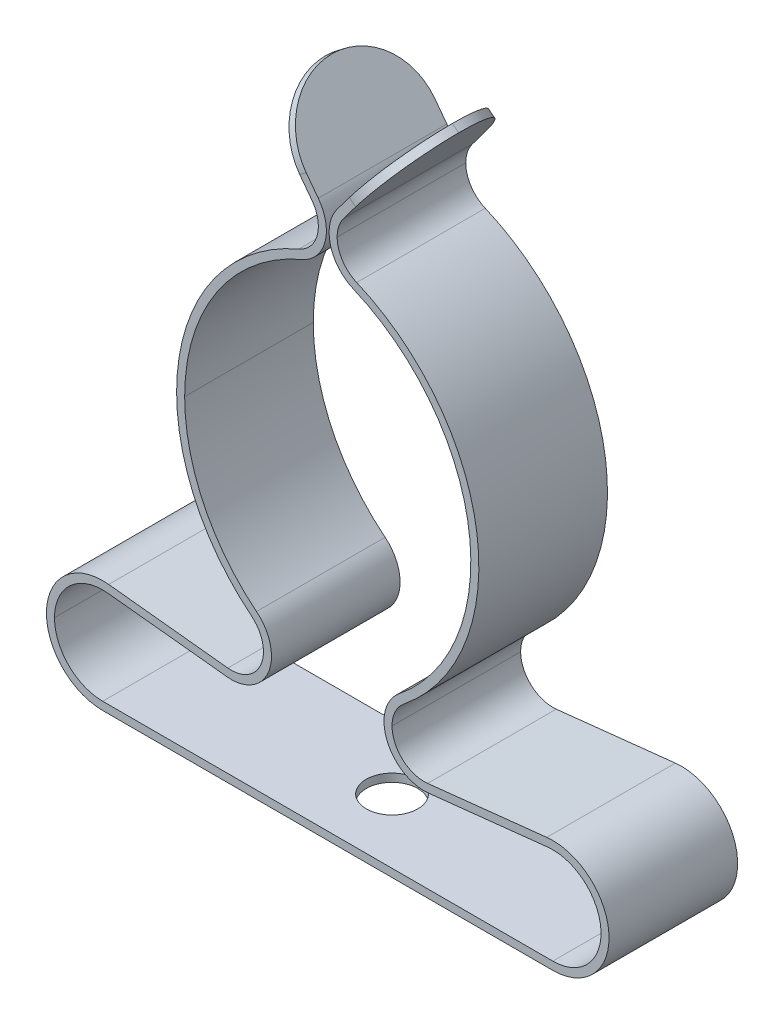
ISO-10303-21;
HEADER;
FILE_DESCRIPTION(('STEP AP214'),'2;1');
FILE_NAME('part.step','',(''),(''),'','','');
FILE_SCHEMA(('AUTOMOTIVE_DESIGN { 1 0 10303 214 1 1 1 1 }'));
ENDSEC;
DATA;
#1=APPLICATION_CONTEXT('core data for automotive mechanical design processes');
#2=APPLICATION_PROTOCOL_DEFINITION('international standard','automotive_design',2000,#1);
#3=PRODUCT_CONTEXT('',#1,'mechanical');
#4=PRODUCT('Part','Part','',(#3));
#5=PRODUCT_RELATED_PRODUCT_CATEGORY('part','',(#4));
#6=PRODUCT_DEFINITION_FORMATION('','',#4);
#7=PRODUCT_DEFINITION_CONTEXT('part definition',#1,'design');
#8=PRODUCT_DEFINITION('design','',#6,#7);
#9=PRODUCT_DEFINITION_SHAPE('','',#8);
#10=(LENGTH_UNIT() NAMED_UNIT(*) SI_UNIT(.MILLI.,.METRE.));
#11=(NAMED_UNIT(*) PLANE_ANGLE_UNIT() SI_UNIT($,.RADIAN.));
#12=(NAMED_UNIT(*) SI_UNIT($,.STERADIAN.) SOLID_ANGLE_UNIT());
#13=UNCERTAINTY_MEASURE_WITH_UNIT(LENGTH_MEASURE(1.E-05),#10,'distance_accuracy_value','');
#14=(GEOMETRIC_REPRESENTATION_CONTEXT(3) GLOBAL_UNCERTAINTY_ASSIGNED_CONTEXT((#13)) GLOBAL_UNIT_ASSIGNED_CONTEXT((#10,
#11,#12)) REPRESENTATION_CONTEXT('',''));
#15=CARTESIAN_POINT('',(0.,0.,0.));
#16=DIRECTION('',(0.,0.,1.));
#17=DIRECTION('',(1.,0.,0.));
#18=AXIS2_PLACEMENT_3D('',#15,#16,#17);
#19=CARTESIAN_POINT('',(3.33888915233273,33.3009588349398,0.));
#20=DIRECTION('',(0.798579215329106,-0.601889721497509,0.));
#21=DIRECTION('',(0.601889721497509,0.798579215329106,0.));
#22=AXIS2_PLACEMENT_3D('',#19,#20,#21);
#23=CYLINDRICAL_SURFACE('',#22,4.);
#24=CARTESIAN_POINT('',(1.34244111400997,34.8056831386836,0.));
#25=DIRECTION('',(-0.798579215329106,0.601889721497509,0.));
#26=DIRECTION('',(-0.601889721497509,-0.798579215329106,0.));
#27=AXIS2_PLACEMENT_3D('',#24,#25,#26);
#28=CIRCLE('',#27,4.);
#29=CARTESIAN_POINT('',(3.75,38.,0.));
#30=VERTEX_POINT('',#29);
#31=CARTESIAN_POINT('',(1.34244111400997,34.8056831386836,-4.));
#32=VERTEX_POINT('',#31);
#33=EDGE_CURVE('E321',#30,#32,#28,.T.);
#34=ORIENTED_EDGE('',*,*,#33,.F.);
#35=DIRECTION('',(0.798579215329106,-0.601889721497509,0.));
#36=VECTOR('',#35,1.);
#37=CARTESIAN_POINT('',(4.14928960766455,37.6990551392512,0.));
#38=LINE('',#37,#36);
#39=CARTESIAN_POINT('',(4.14928960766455,37.6990551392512,0.));
#40=VERTEX_POINT('',#39);
#41=EDGE_CURVE('E9',#30,#40,#38,.T.);
#42=ORIENTED_EDGE('',*,*,#41,.T.);
#43=CARTESIAN_POINT('',(1.74173072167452,34.5047382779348,0.));
#44=DIRECTION('',(0.798579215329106,-0.601889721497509,0.));
#45=DIRECTION('',(-0.601889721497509,-0.798579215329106,0.));
#46=AXIS2_PLACEMENT_3D('',#43,#44,#45);
#47=CIRCLE('',#46,4.);
#48=CARTESIAN_POINT('',(1.74173072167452,34.5047382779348,-4.));
#49=VERTEX_POINT('',#48);
#50=EDGE_CURVE('E406',#49,#40,#47,.T.);
#51=ORIENTED_EDGE('',*,*,#50,.F.);
#52=DIRECTION('',(0.798579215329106,-0.601889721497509,0.));
#53=VECTOR('',#52,1.);
#54=CARTESIAN_POINT('',(3.33888915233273,33.3009588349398,-4.));
#55=LINE('',#54,#53);
#56=EDGE_CURVE('E302',#32,#49,#55,.T.);
#57=ORIENTED_EDGE('',*,*,#56,.F.);
#58=EDGE_LOOP('',(#34,#42,#51,#57));
#59=FACE_BOUND('',#58,.T.);
#60=ADVANCED_FACE('F15',(#59),#23,.T.);
#61=CARTESIAN_POINT('',(1.34244111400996,34.8056831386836,0.));
#62=DIRECTION('',(-0.798579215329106,0.601889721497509,0.));
#63=DIRECTION('',(-0.601889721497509,-0.798579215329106,0.));
#64=AXIS2_PLACEMENT_3D('',#61,#62,#63);
#65=CYLINDRICAL_SURFACE('',#64,4.);
#66=ORIENTED_EDGE('',*,*,#41,.F.);
#67=CARTESIAN_POINT('',(1.34244111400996,34.8056831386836,0.));
#68=DIRECTION('',(-0.798579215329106,0.601889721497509,0.));
#69=DIRECTION('',(-0.601889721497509,-0.798579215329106,0.));
#70=AXIS2_PLACEMENT_3D('',#67,#68,#69);
#71=CIRCLE('',#70,4.);
#72=CARTESIAN_POINT('',(1.34244111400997,34.8056831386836,4.));
#73=VERTEX_POINT('',#72);
#74=EDGE_CURVE('E325',#73,#30,#71,.T.);
#75=ORIENTED_EDGE('',*,*,#74,.F.);
#76=DIRECTION('',(-0.798579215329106,0.601889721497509,0.));
#77=VECTOR('',#76,1.);
#78=CARTESIAN_POINT('',(1.34244111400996,34.8056831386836,4.));
#79=LINE('',#78,#77);
#80=CARTESIAN_POINT('',(1.74173072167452,34.5047382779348,4.));
#81=VERTEX_POINT('',#80);
#82=EDGE_CURVE('E299',#81,#73,#79,.T.);
#83=ORIENTED_EDGE('',*,*,#82,.F.);
#84=CARTESIAN_POINT('',(1.74173072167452,34.5047382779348,0.));
#85=DIRECTION('',(0.798579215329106,-0.601889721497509,0.));
#86=DIRECTION('',(-0.601889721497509,-0.798579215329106,0.));
#87=AXIS2_PLACEMENT_3D('',#84,#85,#86);
#88=CIRCLE('',#87,4.);
#89=EDGE_CURVE('E410',#40,#81,#88,.T.);
#90=ORIENTED_EDGE('',*,*,#89,.F.);
#91=EDGE_LOOP('',(#66,#75,#83,#90));
#92=FACE_BOUND('',#91,.T.);
#93=ADVANCED_FACE('F960',(#92),#65,.T.);
#94=CARTESIAN_POINT('',(-0.0425128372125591,35.7854400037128,0.));
#95=DIRECTION('',(0.798579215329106,0.601889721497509,0.));
#96=DIRECTION('',(-0.601889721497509,0.798579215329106,0.));
#97=AXIS2_PLACEMENT_3D('',#94,#95,#96);
#98=CYLINDRICAL_SURFACE('',#97,4.);
#99=CARTESIAN_POINT('',(-1.74173072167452,34.5047382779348,0.));
#100=DIRECTION('',(-0.798579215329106,-0.601889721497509,0.));
#101=DIRECTION('',(-0.601889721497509,0.798579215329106,0.));
#102=AXIS2_PLACEMENT_3D('',#99,#100,#101);
#103=CIRCLE('',#102,4.);
#104=CARTESIAN_POINT('',(-4.14928960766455,37.6990551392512,0.));
#105=VERTEX_POINT('',#104);
#106=CARTESIAN_POINT('',(-1.74173072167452,34.5047382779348,-4.));
#107=VERTEX_POINT('',#106);
#108=EDGE_CURVE('E458',#105,#107,#103,.T.);
#109=ORIENTED_EDGE('',*,*,#108,.F.);
#110=DIRECTION('',(0.798579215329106,0.601889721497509,0.));
#111=VECTOR('',#110,1.);
#112=CARTESIAN_POINT('',(-3.75,38.,0.));
#113=LINE('',#112,#111);
#114=CARTESIAN_POINT('',(-3.75,38.,0.));
#115=VERTEX_POINT('',#114);
#116=EDGE_CURVE('E23',#105,#115,#113,.T.);
#117=ORIENTED_EDGE('',*,*,#116,.T.);
#118=CARTESIAN_POINT('',(-1.34244111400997,34.8056831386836,0.));
#119=DIRECTION('',(0.798579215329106,0.601889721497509,0.));
#120=DIRECTION('',(-0.601889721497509,0.798579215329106,0.));
#121=AXIS2_PLACEMENT_3D('',#118,#119,#120);
#122=CIRCLE('',#121,4.);
#123=CARTESIAN_POINT('',(-1.34244111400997,34.8056831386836,-4.));
#124=VERTEX_POINT('',#123);
#125=EDGE_CURVE('E531',#124,#115,#122,.T.);
#126=ORIENTED_EDGE('',*,*,#125,.F.);
#127=DIRECTION('',(0.798579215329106,0.601889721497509,0.));
#128=VECTOR('',#127,1.);
#129=CARTESIAN_POINT('',(-0.0425128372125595,35.7854400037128,-4.));
#130=LINE('',#129,#128);
#131=EDGE_CURVE('E300',#107,#124,#130,.T.);
#132=ORIENTED_EDGE('',*,*,#131,.F.);
#133=EDGE_LOOP('',(#109,#117,#126,#132));
#134=FACE_BOUND('',#133,.T.);
#135=ADVANCED_FACE('F919',(#134),#98,.T.);
#136=CARTESIAN_POINT('',(-1.74173072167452,34.5047382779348,0.));
#137=DIRECTION('',(-0.798579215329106,-0.601889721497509,0.));
#138=DIRECTION('',(0.601889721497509,-0.798579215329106,0.));
#139=AXIS2_PLACEMENT_3D('',#136,#137,#138);
#140=CYLINDRICAL_SURFACE('',#139,4.);
#141=ORIENTED_EDGE('',*,*,#116,.F.);
#142=CARTESIAN_POINT('',(-1.74173072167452,34.5047382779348,0.));
#143=DIRECTION('',(-0.798579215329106,-0.601889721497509,0.));
#144=DIRECTION('',(-0.601889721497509,0.798579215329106,0.));
#145=AXIS2_PLACEMENT_3D('',#142,#143,#144);
#146=CIRCLE('',#145,4.);
#147=CARTESIAN_POINT('',(-1.74173072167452,34.5047382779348,4.));
#148=VERTEX_POINT('',#147);
#149=EDGE_CURVE('E454',#148,#105,#146,.T.);
#150=ORIENTED_EDGE('',*,*,#149,.F.);
#151=DIRECTION('',(-0.798579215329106,-0.601889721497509,0.));
#152=VECTOR('',#151,1.);
#153=CARTESIAN_POINT('',(-1.74173072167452,34.5047382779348,4.));
#154=LINE('',#153,#152);
#155=CARTESIAN_POINT('',(-1.34244111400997,34.8056831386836,4.));
#156=VERTEX_POINT('',#155);
#157=EDGE_CURVE('E297',#156,#148,#154,.T.);
#158=ORIENTED_EDGE('',*,*,#157,.F.);
#159=CARTESIAN_POINT('',(-1.34244111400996,34.8056831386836,0.));
#160=DIRECTION('',(0.798579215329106,0.601889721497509,0.));
#161=DIRECTION('',(-0.601889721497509,0.798579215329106,0.));
#162=AXIS2_PLACEMENT_3D('',#159,#160,#161);
#163=CIRCLE('',#162,4.);
#164=EDGE_CURVE('E775',#115,#156,#163,.T.);
#165=ORIENTED_EDGE('',*,*,#164,.F.);
#166=EDGE_LOOP('',(#141,#150,#158,#165));
#167=FACE_BOUND('',#166,.T.);
#168=ADVANCED_FACE('F909',(#167),#140,.T.);
#169=CARTESIAN_POINT('',(0.,4.5254833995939,0.));
#170=DIRECTION('',(0.,-1.,0.));
#171=DIRECTION('',(0.,0.,-1.));
#172=AXIS2_PLACEMENT_3D('',#169,#170,#171);
#173=CYLINDRICAL_SURFACE('',#172,1.6);
#174=DIRECTION('',(0.,-1.,0.));
#175=VECTOR('',#174,1.);
#176=CARTESIAN_POINT('',(0.,4.5254833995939,1.6));
#177=LINE('',#176,#175);
#178=CARTESIAN_POINT('',(0.,0.,1.6));
#179=VERTEX_POINT('',#178);
#180=CARTESIAN_POINT('',(0.,-0.5,1.6));
#181=VERTEX_POINT('',#180);
#182=EDGE_CURVE('E837',#179,#181,#177,.T.);
#183=ORIENTED_EDGE('',*,*,#182,.F.);
#184=CARTESIAN_POINT('',(0.,0.,0.));
#185=DIRECTION('',(0.,-1.,0.));
#186=DIRECTION('',(0.,0.,1.));
#187=AXIS2_PLACEMENT_3D('',#184,#185,#186);
#188=CIRCLE('',#187,1.6);
#189=CARTESIAN_POINT('',(0.,0.,-1.6));
#190=VERTEX_POINT('',#189);
#191=EDGE_CURVE('E506',#190,#179,#188,.T.);
#192=ORIENTED_EDGE('',*,*,#191,.F.);
#193=DIRECTION('',(0.,-1.,0.));
#194=VECTOR('',#193,1.);
#195=CARTESIAN_POINT('',(0.,4.5254833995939,-1.6));
#196=LINE('',#195,#194);
#197=CARTESIAN_POINT('',(0.,-0.5,-1.6));
#198=VERTEX_POINT('',#197);
#199=EDGE_CURVE('E824',#190,#198,#196,.T.);
#200=ORIENTED_EDGE('',*,*,#199,.T.);
#201=CARTESIAN_POINT('',(0.,-0.5,0.));
#202=DIRECTION('',(0.,-1.,0.));
#203=DIRECTION('',(0.,0.,-1.));
#204=AXIS2_PLACEMENT_3D('',#201,#202,#203);
#205=CIRCLE('',#204,1.6);
#206=EDGE_CURVE('E419',#198,#181,#205,.T.);
#207=ORIENTED_EDGE('',*,*,#206,.T.);
#208=EDGE_LOOP('',(#183,#192,#200,#207));
#209=FACE_BOUND('',#208,.T.);
#210=ADVANCED_FACE('F1287',(#209),#173,.F.);
#211=CARTESIAN_POINT('',(2.58446576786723,32.3,-4.));
#212=DIRECTION('',(0.,0.,-1.));
#213=DIRECTION('',(0.,-1.,0.));
#214=AXIS2_PLACEMENT_3D('',#211,#212,#213);
#215=PLANE('',#214);
#216=DIRECTION('',(0.601889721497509,-0.798579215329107,0.));
#217=VECTOR('',#216,1.);
#218=CARTESIAN_POINT('',(-0.987307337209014,33.503779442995,-4.));
#219=LINE('',#218,#217);
#220=CARTESIAN_POINT('',(-0.987307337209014,33.503779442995,-4.));
#221=VERTEX_POINT('',#220);
#222=EDGE_CURVE('E467',#107,#221,#219,.T.);
#223=ORIENTED_EDGE('',*,*,#222,.F.);
#224=ORIENTED_EDGE('',*,*,#131,.T.);
#225=DIRECTION('',(0.601889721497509,-0.798579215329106,0.));
#226=VECTOR('',#225,1.);
#227=CARTESIAN_POINT('',(-0.588017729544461,33.8047243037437,-4.));
#228=LINE('',#227,#226);
#229=CARTESIAN_POINT('',(-0.588017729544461,33.8047243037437,-4.));
#230=VERTEX_POINT('',#229);
#231=EDGE_CURVE('E528',#124,#230,#228,.T.);
#232=ORIENTED_EDGE('',*,*,#231,.T.);
#233=CARTESIAN_POINT('',(-2.58446576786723,32.3,-4.));
#234=DIRECTION('',(0.,0.,-1.));
#235=DIRECTION('',(1.,0.,0.));
#236=AXIS2_PLACEMENT_3D('',#233,#234,#235);
#237=CIRCLE('',#236,2.5);
#238=CARTESIAN_POINT('',(-1.60466987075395,30.,-4.));
#239=VERTEX_POINT('',#238);
#240=EDGE_CURVE('E517',#230,#239,#237,.T.);
#241=ORIENTED_EDGE('',*,*,#240,.T.);
#242=CARTESIAN_POINT('',(3.0983504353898,18.96,-4.));
#243=DIRECTION('',(0.,0.,1.));
#244=DIRECTION('',(-1.,0.,0.));
#245=AXIS2_PLACEMENT_3D('',#242,#243,#244);
#246=CIRCLE('',#245,12.);
#247=CARTESIAN_POINT('',(-8.90164956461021,18.96,-4.));
#248=VERTEX_POINT('',#247);
#249=EDGE_CURVE('E319',#239,#248,#246,.T.);
#250=ORIENTED_EDGE('',*,*,#249,.T.);
#251=CARTESIAN_POINT('',(3.0983504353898,18.96,-4.));
#252=DIRECTION('',(0.,0.,1.));
#253=DIRECTION('',(-1.,0.,0.));
#254=AXIS2_PLACEMENT_3D('',#251,#252,#253);
#255=CIRCLE('',#254,12.);
#256=CARTESIAN_POINT('',(-4.43131889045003,9.61633477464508,-4.));
#257=VERTEX_POINT('',#256);
#258=EDGE_CURVE('E428',#248,#257,#255,.T.);
#259=ORIENTED_EDGE('',*,*,#258,.T.);
#260=CARTESIAN_POINT('',(-6.,7.66973785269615,-4.));
#261=DIRECTION('',(0.,0.,-1.));
#262=DIRECTION('',(1.,0.,0.));
#263=AXIS2_PLACEMENT_3D('',#260,#261,#262);
#264=CIRCLE('',#263,2.5);
#265=CARTESIAN_POINT('',(-6.26785714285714,5.18412876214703,-4.));
#266=VERTEX_POINT('',#265);
#267=EDGE_CURVE('E402',#257,#266,#264,.T.);
#268=ORIENTED_EDGE('',*,*,#267,.T.);
#269=DIRECTION('',(-0.994243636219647,0.107142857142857,0.));
#270=VECTOR('',#269,1.);
#271=CARTESIAN_POINT('',(-13.6785714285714,5.98273090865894,-4.));
#272=LINE('',#271,#270);
#273=CARTESIAN_POINT('',(-13.6785714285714,5.98273090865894,-4.));
#274=VERTEX_POINT('',#273);
#275=EDGE_CURVE('E385',#266,#274,#272,.T.);
#276=ORIENTED_EDGE('',*,*,#275,.T.);
#277=CARTESIAN_POINT('',(-14.,3.,-4.));
#278=DIRECTION('',(0.,0.,1.));
#279=DIRECTION('',(-1.,0.,0.));
#280=AXIS2_PLACEMENT_3D('',#277,#278,#279);
#281=CIRCLE('',#280,3.);
#282=CARTESIAN_POINT('',(-17.,3.,-4.));
#283=VERTEX_POINT('',#282);
#284=EDGE_CURVE('E338',#274,#283,#281,.T.);
#285=ORIENTED_EDGE('',*,*,#284,.T.);
#286=CARTESIAN_POINT('',(-14.,3.,-4.));
#287=DIRECTION('',(0.,0.,1.));
#288=DIRECTION('',(-1.,0.,0.));
#289=AXIS2_PLACEMENT_3D('',#286,#287,#288);
#290=CIRCLE('',#289,3.);
#291=CARTESIAN_POINT('',(-14.,0.,-4.));
#292=VERTEX_POINT('',#291);
#293=EDGE_CURVE('E389',#283,#292,#290,.T.);
#294=ORIENTED_EDGE('',*,*,#293,.T.);
#295=DIRECTION('',(1.,0.,0.));
#296=VECTOR('',#295,1.);
#297=CARTESIAN_POINT('',(-14.,0.,-4.));
#298=LINE('',#297,#296);
#299=CARTESIAN_POINT('',(14.,0.,-4.));
#300=VERTEX_POINT('',#299);
#301=EDGE_CURVE('E495',#292,#300,#298,.T.);
#302=ORIENTED_EDGE('',*,*,#301,.T.);
#303=CARTESIAN_POINT('',(14.,3.,-4.));
#304=DIRECTION('',(0.,0.,1.));
#305=DIRECTION('',(1.,0.,0.));
#306=AXIS2_PLACEMENT_3D('',#303,#304,#305);
#307=CIRCLE('',#306,3.);
#308=CARTESIAN_POINT('',(13.6785714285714,5.98273090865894,-4.));
#309=VERTEX_POINT('',#308);
#310=EDGE_CURVE('E481',#300,#309,#307,.T.);
#311=ORIENTED_EDGE('',*,*,#310,.T.);
#312=DIRECTION('',(-0.994243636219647,-0.107142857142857,0.));
#313=VECTOR('',#312,1.);
#314=CARTESIAN_POINT('',(13.6785714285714,5.98273090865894,-4.));
#315=LINE('',#314,#313);
#316=CARTESIAN_POINT('',(6.26785714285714,5.18412876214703,-4.));
#317=VERTEX_POINT('',#316);
#318=EDGE_CURVE('E350',#309,#317,#315,.T.);
#319=ORIENTED_EDGE('',*,*,#318,.T.);
#320=CARTESIAN_POINT('',(6.,7.66973785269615,-4.));
#321=DIRECTION('',(0.,0.,-1.));
#322=DIRECTION('',(-1.,0.,0.));
#323=AXIS2_PLACEMENT_3D('',#320,#321,#322);
#324=CIRCLE('',#323,2.5);
#325=CARTESIAN_POINT('',(3.5,7.66973785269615,-4.));
#326=VERTEX_POINT('',#325);
#327=EDGE_CURVE('E368',#317,#326,#324,.T.);
#328=ORIENTED_EDGE('',*,*,#327,.T.);
#329=CARTESIAN_POINT('',(6.,7.66973785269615,-4.));
#330=DIRECTION('',(0.,0.,-1.));
#331=DIRECTION('',(-1.,0.,0.));
#332=AXIS2_PLACEMENT_3D('',#329,#330,#331);
#333=CIRCLE('',#332,2.5);
#334=CARTESIAN_POINT('',(4.43131889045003,9.61633477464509,-4.));
#335=VERTEX_POINT('',#334);
#336=EDGE_CURVE('E470',#326,#335,#333,.T.);
#337=ORIENTED_EDGE('',*,*,#336,.T.);
#338=CARTESIAN_POINT('',(-3.0983504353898,18.96,-4.));
#339=DIRECTION('',(0.,0.,1.));
#340=DIRECTION('',(1.,0.,0.));
#341=AXIS2_PLACEMENT_3D('',#338,#339,#340);
#342=CIRCLE('',#341,12.);
#343=CARTESIAN_POINT('',(1.60466987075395,30.,-4.));
#344=VERTEX_POINT('',#343);
#345=EDGE_CURVE('E446',#335,#344,#342,.T.);
#346=ORIENTED_EDGE('',*,*,#345,.T.);
#347=CARTESIAN_POINT('',(2.58446576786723,32.3,-4.));
#348=DIRECTION('',(0.,0.,-1.));
#349=DIRECTION('',(-1.,0.,0.));
#350=AXIS2_PLACEMENT_3D('',#347,#348,#349);
#351=CIRCLE('',#350,2.5);
#352=CARTESIAN_POINT('',(0.0844657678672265,32.3,-4.));
#353=VERTEX_POINT('',#352);
#354=EDGE_CURVE('E384',#344,#353,#351,.T.);
#355=ORIENTED_EDGE('',*,*,#354,.T.);
#356=CARTESIAN_POINT('',(2.58446576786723,32.3,-4.));
#357=DIRECTION('',(0.,0.,-1.));
#358=DIRECTION('',(-1.,0.,0.));
#359=AXIS2_PLACEMENT_3D('',#356,#357,#358);
#360=CIRCLE('',#359,2.5);
#361=CARTESIAN_POINT('',(0.588017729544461,33.8047243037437,-4.));
#362=VERTEX_POINT('',#361);
#363=EDGE_CURVE('E445',#353,#362,#360,.T.);
#364=ORIENTED_EDGE('',*,*,#363,.T.);
#365=DIRECTION('',(0.601889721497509,0.798579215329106,0.));
#366=VECTOR('',#365,1.);
#367=CARTESIAN_POINT('',(0.588017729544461,33.8047243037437,-4.));
#368=LINE('',#367,#366);
#369=EDGE_CURVE('E324',#362,#32,#368,.T.);
#370=ORIENTED_EDGE('',*,*,#369,.T.);
#371=ORIENTED_EDGE('',*,*,#56,.T.);
#372=DIRECTION('',(0.601889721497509,0.798579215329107,0.));
#373=VECTOR('',#372,1.);
#374=CARTESIAN_POINT('',(0.987307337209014,33.503779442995,-4.));
#375=LINE('',#374,#373);
#376=CARTESIAN_POINT('',(0.987307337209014,33.503779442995,-4.));
#377=VERTEX_POINT('',#376);
#378=EDGE_CURVE('E401',#377,#49,#375,.T.);
#379=ORIENTED_EDGE('',*,*,#378,.F.);
#380=CARTESIAN_POINT('',(2.58446576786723,32.3,-4.));
#381=DIRECTION('',(0.,0.,-1.));
#382=DIRECTION('',(1.,0.,0.));
#383=AXIS2_PLACEMENT_3D('',#380,#381,#382);
#384=CIRCLE('',#383,2.);
#385=CARTESIAN_POINT('',(0.584465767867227,32.3,-4.));
#386=VERTEX_POINT('',#385);
#387=EDGE_CURVE('E794',#386,#377,#384,.T.);
#388=ORIENTED_EDGE('',*,*,#387,.F.);
#389=CARTESIAN_POINT('',(2.58446576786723,32.3,-4.));
#390=DIRECTION('',(0.,0.,-1.));
#391=DIRECTION('',(1.,0.,0.));
#392=AXIS2_PLACEMENT_3D('',#389,#390,#391);
#393=CIRCLE('',#392,2.);
#394=CARTESIAN_POINT('',(1.80062905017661,30.46,-4.));
#395=VERTEX_POINT('',#394);
#396=EDGE_CURVE('E47',#395,#386,#393,.T.);
#397=ORIENTED_EDGE('',*,*,#396,.F.);
#398=CARTESIAN_POINT('',(-3.0983504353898,18.96,-4.));
#399=DIRECTION('',(0.,0.,1.));
#400=DIRECTION('',(1.,0.,0.));
#401=AXIS2_PLACEMENT_3D('',#398,#399,#400);
#402=CIRCLE('',#401,12.5);
#403=CARTESIAN_POINT('',(4.74505511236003,9.22701539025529,-4.));
#404=VERTEX_POINT('',#403);
#405=EDGE_CURVE('E257',#404,#395,#402,.T.);
#406=ORIENTED_EDGE('',*,*,#405,.F.);
#407=CARTESIAN_POINT('',(6.,7.66973785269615,-4.));
#408=DIRECTION('',(0.,0.,-1.));
#409=DIRECTION('',(1.,0.,0.));
#410=AXIS2_PLACEMENT_3D('',#407,#408,#409);
#411=CIRCLE('',#410,2.);
#412=CARTESIAN_POINT('',(4.,7.66973785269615,-4.));
#413=VERTEX_POINT('',#412);
#414=EDGE_CURVE('E252',#413,#404,#411,.T.);
#415=ORIENTED_EDGE('',*,*,#414,.F.);
#416=CARTESIAN_POINT('',(6.,7.66973785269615,-4.));
#417=DIRECTION('',(0.,0.,-1.));
#418=DIRECTION('',(1.,0.,0.));
#419=AXIS2_PLACEMENT_3D('',#416,#417,#418);
#420=CIRCLE('',#419,2.);
#421=CARTESIAN_POINT('',(6.21428571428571,5.68125058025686,-4.));
#422=VERTEX_POINT('',#421);
#423=EDGE_CURVE('E242',#422,#413,#420,.T.);
#424=ORIENTED_EDGE('',*,*,#423,.F.);
#425=DIRECTION('',(-0.994243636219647,-0.107142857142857,0.));
#426=VECTOR('',#425,1.);
#427=CARTESIAN_POINT('',(13.625,6.47985272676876,-4.));
#428=LINE('',#427,#426);
#429=CARTESIAN_POINT('',(13.625,6.47985272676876,-4.));
#430=VERTEX_POINT('',#429);
#431=EDGE_CURVE('E248',#430,#422,#428,.T.);
#432=ORIENTED_EDGE('',*,*,#431,.F.);
#433=CARTESIAN_POINT('',(14.,3.,-4.));
#434=DIRECTION('',(0.,0.,1.));
#435=DIRECTION('',(1.,0.,0.));
#436=AXIS2_PLACEMENT_3D('',#433,#434,#435);
#437=CIRCLE('',#436,3.5);
#438=CARTESIAN_POINT('',(14.,-0.5,-4.));
#439=VERTEX_POINT('',#438);
#440=EDGE_CURVE('E423',#439,#430,#437,.T.);
#441=ORIENTED_EDGE('',*,*,#440,.F.);
#442=DIRECTION('',(1.,0.,0.));
#443=VECTOR('',#442,1.);
#444=CARTESIAN_POINT('',(-14.,-0.5,-4.));
#445=LINE('',#444,#443);
#446=CARTESIAN_POINT('',(-14.,-0.5,-4.));
#447=VERTEX_POINT('',#446);
#448=EDGE_CURVE('E575',#447,#439,#445,.T.);
#449=ORIENTED_EDGE('',*,*,#448,.F.);
#450=CARTESIAN_POINT('',(-14.,3.,-4.));
#451=DIRECTION('',(0.,0.,1.));
#452=DIRECTION('',(1.,0.,0.));
#453=AXIS2_PLACEMENT_3D('',#450,#451,#452);
#454=CIRCLE('',#453,3.5);
#455=CARTESIAN_POINT('',(-17.5,3.,-4.));
#456=VERTEX_POINT('',#455);
#457=EDGE_CURVE('E772',#456,#447,#454,.T.);
#458=ORIENTED_EDGE('',*,*,#457,.F.);
#459=CARTESIAN_POINT('',(-14.,3.,-4.));
#460=DIRECTION('',(0.,0.,1.));
#461=DIRECTION('',(1.,0.,0.));
#462=AXIS2_PLACEMENT_3D('',#459,#460,#461);
#463=CIRCLE('',#462,3.5);
#464=CARTESIAN_POINT('',(-13.625,6.47985272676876,-4.));
#465=VERTEX_POINT('',#464);
#466=EDGE_CURVE('E574',#465,#456,#463,.T.);
#467=ORIENTED_EDGE('',*,*,#466,.F.);
#468=DIRECTION('',(-0.994243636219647,0.107142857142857,0.));
#469=VECTOR('',#468,1.);
#470=CARTESIAN_POINT('',(-13.625,6.47985272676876,-4.));
#471=LINE('',#470,#469);
#472=CARTESIAN_POINT('',(-6.21428571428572,5.68125058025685,-4.));
#473=VERTEX_POINT('',#472);
#474=EDGE_CURVE('E558',#473,#465,#471,.T.);
#475=ORIENTED_EDGE('',*,*,#474,.F.);
#476=CARTESIAN_POINT('',(-6.,7.66973785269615,-4.));
#477=DIRECTION('',(0.,0.,-1.));
#478=DIRECTION('',(1.,0.,0.));
#479=AXIS2_PLACEMENT_3D('',#476,#477,#478);
#480=CIRCLE('',#479,2.);
#481=CARTESIAN_POINT('',(-4.74505511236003,9.2270153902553,-4.));
#482=VERTEX_POINT('',#481);
#483=EDGE_CURVE('E546',#482,#473,#480,.T.);
#484=ORIENTED_EDGE('',*,*,#483,.F.);
#485=CARTESIAN_POINT('',(3.0983504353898,18.96,-4.));
#486=DIRECTION('',(0.,0.,1.));
#487=DIRECTION('',(1.,0.,0.));
#488=AXIS2_PLACEMENT_3D('',#485,#486,#487);
#489=CIRCLE('',#488,12.5);
#490=CARTESIAN_POINT('',(-9.40164956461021,18.96,-4.));
#491=VERTEX_POINT('',#490);
#492=EDGE_CURVE('E757',#491,#482,#489,.T.);
#493=ORIENTED_EDGE('',*,*,#492,.F.);
#494=CARTESIAN_POINT('',(3.0983504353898,18.96,-4.));
#495=DIRECTION('',(0.,0.,1.));
#496=DIRECTION('',(1.,0.,0.));
#497=AXIS2_PLACEMENT_3D('',#494,#495,#496);
#498=CIRCLE('',#497,12.5);
#499=CARTESIAN_POINT('',(-1.8006290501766,30.46,-4.));
#500=VERTEX_POINT('',#499);
#501=EDGE_CURVE('E545',#500,#491,#498,.T.);
#502=ORIENTED_EDGE('',*,*,#501,.F.);
#503=CARTESIAN_POINT('',(-2.58446576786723,32.3,-4.));
#504=DIRECTION('',(0.,0.,-1.));
#505=DIRECTION('',(1.,0.,0.));
#506=AXIS2_PLACEMENT_3D('',#503,#504,#505);
#507=CIRCLE('',#506,2.);
#508=EDGE_CURVE('E343',#221,#500,#507,.T.);
#509=ORIENTED_EDGE('',*,*,#508,.F.);
#510=EDGE_LOOP('',(#223,#224,#232,#241,#250,#259,#268,#276,#285,#294,#302,#311,#319,#328,#337,
#346,#355,#364,#370,#371,#379,#388,#397,#406,#415,#424,#432,#441,#449,#458,#467,#475,#484,#493,
#502,#509));
#511=FACE_BOUND('',#510,.T.);
#512=ADVANCED_FACE('F245',(#511),#215,.T.);
#513=CARTESIAN_POINT('',(2.58446576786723,32.3,4.));
#514=DIRECTION('',(0.,0.,-1.));
#515=DIRECTION('',(0.,-1.,0.));
#516=AXIS2_PLACEMENT_3D('',#513,#514,#515);
#517=PLANE('',#516);
#518=DIRECTION('',(0.601889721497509,-0.798579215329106,0.));
#519=VECTOR('',#518,1.);
#520=CARTESIAN_POINT('',(-0.588017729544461,33.8047243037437,4.));
#521=LINE('',#520,#519);
#522=CARTESIAN_POINT('',(-0.588017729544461,33.8047243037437,4.));
#523=VERTEX_POINT('',#522);
#524=EDGE_CURVE('E459',#156,#523,#521,.T.);
#525=ORIENTED_EDGE('',*,*,#524,.F.);
#526=ORIENTED_EDGE('',*,*,#157,.T.);
#527=DIRECTION('',(0.601889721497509,-0.798579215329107,0.));
#528=VECTOR('',#527,1.);
#529=CARTESIAN_POINT('',(-0.987307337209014,33.503779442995,4.));
#530=LINE('',#529,#528);
#531=CARTESIAN_POINT('',(-0.987307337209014,33.503779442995,4.));
#532=VERTEX_POINT('',#531);
#533=EDGE_CURVE('E339',#148,#532,#530,.T.);
#534=ORIENTED_EDGE('',*,*,#533,.T.);
#535=CARTESIAN_POINT('',(-2.58446576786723,32.3,4.));
#536=DIRECTION('',(0.,0.,-1.));
#537=DIRECTION('',(1.,0.,0.));
#538=AXIS2_PLACEMENT_3D('',#535,#536,#537);
#539=CIRCLE('',#538,2.);
#540=CARTESIAN_POINT('',(-1.8006290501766,30.46,4.));
#541=VERTEX_POINT('',#540);
#542=EDGE_CURVE('E486',#532,#541,#539,.T.);
#543=ORIENTED_EDGE('',*,*,#542,.T.);
#544=CARTESIAN_POINT('',(3.0983504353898,18.96,4.));
#545=DIRECTION('',(0.,0.,1.));
#546=DIRECTION('',(1.,0.,0.));
#547=AXIS2_PLACEMENT_3D('',#544,#545,#546);
#548=CIRCLE('',#547,12.5);
#549=CARTESIAN_POINT('',(-9.40164956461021,18.96,4.));
#550=VERTEX_POINT('',#549);
#551=EDGE_CURVE('E541',#541,#550,#548,.T.);
#552=ORIENTED_EDGE('',*,*,#551,.T.);
#553=CARTESIAN_POINT('',(3.0983504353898,18.96,4.));
#554=DIRECTION('',(0.,0.,1.));
#555=DIRECTION('',(1.,0.,0.));
#556=AXIS2_PLACEMENT_3D('',#553,#554,#555);
#557=CIRCLE('',#556,12.5);
#558=CARTESIAN_POINT('',(-4.74505511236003,9.2270153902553,4.));
#559=VERTEX_POINT('',#558);
#560=EDGE_CURVE('E765',#550,#559,#557,.T.);
#561=ORIENTED_EDGE('',*,*,#560,.T.);
#562=CARTESIAN_POINT('',(-6.,7.66973785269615,4.));
#563=DIRECTION('',(0.,0.,-1.));
#564=DIRECTION('',(1.,0.,0.));
#565=AXIS2_PLACEMENT_3D('',#562,#563,#564);
#566=CIRCLE('',#565,2.);
#567=CARTESIAN_POINT('',(-6.21428571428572,5.68125058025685,4.));
#568=VERTEX_POINT('',#567);
#569=EDGE_CURVE('E554',#559,#568,#566,.T.);
#570=ORIENTED_EDGE('',*,*,#569,.T.);
#571=DIRECTION('',(-0.994243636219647,0.107142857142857,0.));
#572=VECTOR('',#571,1.);
#573=CARTESIAN_POINT('',(-13.625,6.47985272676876,4.));
#574=LINE('',#573,#572);
#575=CARTESIAN_POINT('',(-13.625,6.47985272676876,4.));
#576=VERTEX_POINT('',#575);
#577=EDGE_CURVE('E566',#568,#576,#574,.T.);
#578=ORIENTED_EDGE('',*,*,#577,.T.);
#579=CARTESIAN_POINT('',(-14.,3.,4.));
#580=DIRECTION('',(0.,0.,1.));
#581=DIRECTION('',(1.,0.,0.));
#582=AXIS2_PLACEMENT_3D('',#579,#580,#581);
#583=CIRCLE('',#582,3.5);
#584=CARTESIAN_POINT('',(-17.5,3.,4.));
#585=VERTEX_POINT('',#584);
#586=EDGE_CURVE('E570',#576,#585,#583,.T.);
#587=ORIENTED_EDGE('',*,*,#586,.T.);
#588=CARTESIAN_POINT('',(-14.,3.,4.));
#589=DIRECTION('',(0.,0.,1.));
#590=DIRECTION('',(1.,0.,0.));
#591=AXIS2_PLACEMENT_3D('',#588,#589,#590);
#592=CIRCLE('',#591,3.5);
#593=CARTESIAN_POINT('',(-14.,-0.5,4.));
#594=VERTEX_POINT('',#593);
#595=EDGE_CURVE('E776',#585,#594,#592,.T.);
#596=ORIENTED_EDGE('',*,*,#595,.T.);
#597=DIRECTION('',(1.,0.,0.));
#598=VECTOR('',#597,1.);
#599=CARTESIAN_POINT('',(-14.,-0.5,4.));
#600=LINE('',#599,#598);
#601=CARTESIAN_POINT('',(14.,-0.5,4.));
#602=VERTEX_POINT('',#601);
#603=EDGE_CURVE('E424',#594,#602,#600,.T.);
#604=ORIENTED_EDGE('',*,*,#603,.T.);
#605=CARTESIAN_POINT('',(14.,3.,4.));
#606=DIRECTION('',(0.,0.,1.));
#607=DIRECTION('',(1.,0.,0.));
#608=AXIS2_PLACEMENT_3D('',#605,#606,#607);
#609=CIRCLE('',#608,3.5);
#610=CARTESIAN_POINT('',(13.625,6.47985272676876,4.));
#611=VERTEX_POINT('',#610);
#612=EDGE_CURVE('E274',#602,#611,#609,.T.);
#613=ORIENTED_EDGE('',*,*,#612,.T.);
#614=DIRECTION('',(-0.994243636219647,-0.107142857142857,0.));
#615=VECTOR('',#614,1.);
#616=CARTESIAN_POINT('',(13.625,6.47985272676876,4.));
#617=LINE('',#616,#615);
#618=CARTESIAN_POINT('',(6.21428571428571,5.68125058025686,4.));
#619=VERTEX_POINT('',#618);
#620=EDGE_CURVE('E267',#611,#619,#617,.T.);
#621=ORIENTED_EDGE('',*,*,#620,.T.);
#622=CARTESIAN_POINT('',(6.,7.66973785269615,4.));
#623=DIRECTION('',(0.,0.,-1.));
#624=DIRECTION('',(1.,0.,0.));
#625=AXIS2_PLACEMENT_3D('',#622,#623,#624);
#626=CIRCLE('',#625,2.);
#627=CARTESIAN_POINT('',(4.,7.66973785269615,4.));
#628=VERTEX_POINT('',#627);
#629=EDGE_CURVE('E258',#619,#628,#626,.T.);
#630=ORIENTED_EDGE('',*,*,#629,.T.);
#631=CARTESIAN_POINT('',(6.,7.66973785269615,4.));
#632=DIRECTION('',(0.,0.,-1.));
#633=DIRECTION('',(1.,0.,0.));
#634=AXIS2_PLACEMENT_3D('',#631,#632,#633);
#635=CIRCLE('',#634,2.);
#636=CARTESIAN_POINT('',(4.74505511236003,9.22701539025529,4.));
#637=VERTEX_POINT('',#636);
#638=EDGE_CURVE('E785',#628,#637,#635,.T.);
#639=ORIENTED_EDGE('',*,*,#638,.T.);
#640=CARTESIAN_POINT('',(-3.0983504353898,18.96,4.));
#641=DIRECTION('',(0.,0.,1.));
#642=DIRECTION('',(1.,0.,0.));
#643=AXIS2_PLACEMENT_3D('',#640,#641,#642);
#644=CIRCLE('',#643,12.5);
#645=CARTESIAN_POINT('',(1.80062905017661,30.46,4.));
#646=VERTEX_POINT('',#645);
#647=EDGE_CURVE('E292',#637,#646,#644,.T.);
#648=ORIENTED_EDGE('',*,*,#647,.T.);
#649=CARTESIAN_POINT('',(2.58446576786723,32.3,4.));
#650=DIRECTION('',(0.,0.,-1.));
#651=DIRECTION('',(1.,0.,0.));
#652=AXIS2_PLACEMENT_3D('',#649,#650,#651);
#653=CIRCLE('',#652,2.);
#654=CARTESIAN_POINT('',(0.584465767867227,32.3,4.));
#655=VERTEX_POINT('',#654);
#656=EDGE_CURVE('E34',#646,#655,#653,.T.);
#657=ORIENTED_EDGE('',*,*,#656,.T.);
#658=CARTESIAN_POINT('',(2.58446576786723,32.3,4.));
#659=DIRECTION('',(0.,0.,-1.));
#660=DIRECTION('',(1.,0.,0.));
#661=AXIS2_PLACEMENT_3D('',#658,#659,#660);
#662=CIRCLE('',#661,2.);
#663=CARTESIAN_POINT('',(0.987307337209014,33.503779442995,4.));
#664=VERTEX_POINT('',#663);
#665=EDGE_CURVE('E817',#655,#664,#662,.T.);
#666=ORIENTED_EDGE('',*,*,#665,.T.);
#667=DIRECTION('',(0.601889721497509,0.798579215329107,0.));
#668=VECTOR('',#667,1.);
#669=CARTESIAN_POINT('',(0.987307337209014,33.503779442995,4.));
#670=LINE('',#669,#668);
#671=EDGE_CURVE('E418',#664,#81,#670,.T.);
#672=ORIENTED_EDGE('',*,*,#671,.T.);
#673=ORIENTED_EDGE('',*,*,#82,.T.);
#674=DIRECTION('',(0.601889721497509,0.798579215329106,0.));
#675=VECTOR('',#674,1.);
#676=CARTESIAN_POINT('',(0.588017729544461,33.8047243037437,4.));
#677=LINE('',#676,#675);
#678=CARTESIAN_POINT('',(0.588017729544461,33.8047243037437,4.));
#679=VERTEX_POINT('',#678);
#680=EDGE_CURVE('E439',#679,#73,#677,.T.);
#681=ORIENTED_EDGE('',*,*,#680,.F.);
#682=CARTESIAN_POINT('',(2.58446576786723,32.3,4.));
#683=DIRECTION('',(0.,0.,-1.));
#684=DIRECTION('',(-1.,0.,0.));
#685=AXIS2_PLACEMENT_3D('',#682,#683,#684);
#686=CIRCLE('',#685,2.5);
#687=CARTESIAN_POINT('',(0.0844657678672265,32.3,4.));
#688=VERTEX_POINT('',#687);
#689=EDGE_CURVE('E442',#688,#679,#686,.T.);
#690=ORIENTED_EDGE('',*,*,#689,.F.);
#691=CARTESIAN_POINT('',(2.58446576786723,32.3,4.));
#692=DIRECTION('',(0.,0.,-1.));
#693=DIRECTION('',(-1.,0.,0.));
#694=AXIS2_PLACEMENT_3D('',#691,#692,#693);
#695=CIRCLE('',#694,2.5);
#696=CARTESIAN_POINT('',(1.60466987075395,30.,4.));
#697=VERTEX_POINT('',#696);
#698=EDGE_CURVE('E376',#697,#688,#695,.T.);
#699=ORIENTED_EDGE('',*,*,#698,.F.);
#700=CARTESIAN_POINT('',(-3.0983504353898,18.96,4.));
#701=DIRECTION('',(0.,0.,1.));
#702=DIRECTION('',(1.,0.,0.));
#703=AXIS2_PLACEMENT_3D('',#700,#701,#702);
#704=CIRCLE('',#703,12.);
#705=CARTESIAN_POINT('',(4.43131889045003,9.61633477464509,4.));
#706=VERTEX_POINT('',#705);
#707=EDGE_CURVE('E453',#706,#697,#704,.T.);
#708=ORIENTED_EDGE('',*,*,#707,.F.);
#709=CARTESIAN_POINT('',(6.,7.66973785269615,4.));
#710=DIRECTION('',(0.,0.,-1.));
#711=DIRECTION('',(-1.,0.,0.));
#712=AXIS2_PLACEMENT_3D('',#709,#710,#711);
#713=CIRCLE('',#712,2.5);
#714=CARTESIAN_POINT('',(3.5,7.66973785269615,4.));
#715=VERTEX_POINT('',#714);
#716=EDGE_CURVE('E463',#715,#706,#713,.T.);
#717=ORIENTED_EDGE('',*,*,#716,.F.);
#718=CARTESIAN_POINT('',(6.,7.66973785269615,4.));
#719=DIRECTION('',(0.,0.,-1.));
#720=DIRECTION('',(-1.,0.,0.));
#721=AXIS2_PLACEMENT_3D('',#718,#719,#720);
#722=CIRCLE('',#721,2.5);
#723=CARTESIAN_POINT('',(6.26785714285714,5.18412876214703,4.));
#724=VERTEX_POINT('',#723);
#725=EDGE_CURVE('E360',#724,#715,#722,.T.);
#726=ORIENTED_EDGE('',*,*,#725,.F.);
#727=DIRECTION('',(-0.994243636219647,-0.107142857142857,0.));
#728=VECTOR('',#727,1.);
#729=CARTESIAN_POINT('',(13.6785714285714,5.98273090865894,4.));
#730=LINE('',#729,#728);
#731=CARTESIAN_POINT('',(13.6785714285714,5.98273090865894,4.));
#732=VERTEX_POINT('',#731);
#733=EDGE_CURVE('E349',#732,#724,#730,.T.);
#734=ORIENTED_EDGE('',*,*,#733,.F.);
#735=CARTESIAN_POINT('',(14.,3.,4.));
#736=DIRECTION('',(0.,0.,1.));
#737=DIRECTION('',(1.,0.,0.));
#738=AXIS2_PLACEMENT_3D('',#735,#736,#737);
#739=CIRCLE('',#738,3.);
#740=CARTESIAN_POINT('',(14.,0.,4.));
#741=VERTEX_POINT('',#740);
#742=EDGE_CURVE('E493',#741,#732,#739,.T.);
#743=ORIENTED_EDGE('',*,*,#742,.F.);
#744=DIRECTION('',(1.,0.,0.));
#745=VECTOR('',#744,1.);
#746=CARTESIAN_POINT('',(-14.,0.,4.));
#747=LINE('',#746,#745);
#748=CARTESIAN_POINT('',(-14.,0.,4.));
#749=VERTEX_POINT('',#748);
#750=EDGE_CURVE('E503',#749,#741,#747,.T.);
#751=ORIENTED_EDGE('',*,*,#750,.F.);
#752=CARTESIAN_POINT('',(-14.,3.,4.));
#753=DIRECTION('',(0.,0.,1.));
#754=DIRECTION('',(-1.,0.,0.));
#755=AXIS2_PLACEMENT_3D('',#752,#753,#754);
#756=CIRCLE('',#755,3.);
#757=CARTESIAN_POINT('',(-17.,3.,4.));
#758=VERTEX_POINT('',#757);
#759=EDGE_CURVE('E510',#758,#749,#756,.T.);
#760=ORIENTED_EDGE('',*,*,#759,.F.);
#761=CARTESIAN_POINT('',(-14.,3.,4.));
#762=DIRECTION('',(0.,0.,1.));
#763=DIRECTION('',(-1.,0.,0.));
#764=AXIS2_PLACEMENT_3D('',#761,#762,#763);
#765=CIRCLE('',#764,3.);
#766=CARTESIAN_POINT('',(-13.6785714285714,5.98273090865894,4.));
#767=VERTEX_POINT('',#766);
#768=EDGE_CURVE('E330',#767,#758,#765,.T.);
#769=ORIENTED_EDGE('',*,*,#768,.F.);
#770=DIRECTION('',(-0.994243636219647,0.107142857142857,0.));
#771=VECTOR('',#770,1.);
#772=CARTESIAN_POINT('',(-13.6785714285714,5.98273090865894,4.));
#773=LINE('',#772,#771);
#774=CARTESIAN_POINT('',(-6.26785714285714,5.18412876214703,4.));
#775=VERTEX_POINT('',#774);
#776=EDGE_CURVE('E397',#775,#767,#773,.T.);
#777=ORIENTED_EDGE('',*,*,#776,.F.);
#778=CARTESIAN_POINT('',(-6.,7.66973785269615,4.));
#779=DIRECTION('',(0.,0.,-1.));
#780=DIRECTION('',(1.,0.,0.));
#781=AXIS2_PLACEMENT_3D('',#778,#779,#780);
#782=CIRCLE('',#781,2.5);
#783=CARTESIAN_POINT('',(-4.43131889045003,9.61633477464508,4.));
#784=VERTEX_POINT('',#783);
#785=EDGE_CURVE('E414',#784,#775,#782,.T.);
#786=ORIENTED_EDGE('',*,*,#785,.F.);
#787=CARTESIAN_POINT('',(3.0983504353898,18.96,4.));
#788=DIRECTION('',(0.,0.,1.));
#789=DIRECTION('',(-1.,0.,0.));
#790=AXIS2_PLACEMENT_3D('',#787,#788,#789);
#791=CIRCLE('',#790,12.);
#792=CARTESIAN_POINT('',(-8.90164956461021,18.96,4.));
#793=VERTEX_POINT('',#792);
#794=EDGE_CURVE('E425',#793,#784,#791,.T.);
#795=ORIENTED_EDGE('',*,*,#794,.F.);
#796=CARTESIAN_POINT('',(3.0983504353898,18.96,4.));
#797=DIRECTION('',(0.,0.,1.));
#798=DIRECTION('',(-1.,0.,0.));
#799=AXIS2_PLACEMENT_3D('',#796,#797,#798);
#800=CIRCLE('',#799,12.);
#801=CARTESIAN_POINT('',(-1.60466987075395,30.,4.));
#802=VERTEX_POINT('',#801);
#803=EDGE_CURVE('E745',#802,#793,#800,.T.);
#804=ORIENTED_EDGE('',*,*,#803,.F.);
#805=CARTESIAN_POINT('',(-2.58446576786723,32.3,4.));
#806=DIRECTION('',(0.,0.,-1.));
#807=DIRECTION('',(1.,0.,0.));
#808=AXIS2_PLACEMENT_3D('',#805,#806,#807);
#809=CIRCLE('',#808,2.5);
#810=EDGE_CURVE('E524',#523,#802,#809,.T.);
#811=ORIENTED_EDGE('',*,*,#810,.F.);
#812=EDGE_LOOP('',(#525,#526,#534,#543,#552,#561,#570,#578,#587,#596,#604,#613,#621,#630,#639,
#648,#657,#666,#672,#673,#681,#690,#699,#708,#717,#726,#734,#743,#751,#760,#769,#777,#786,#795,
#804,#811));
#813=FACE_BOUND('',#812,.T.);
#814=ADVANCED_FACE('F912',(#813),#517,.F.);
#815=CARTESIAN_POINT('',(2.58446576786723,32.3,4.));
#816=DIRECTION('',(0.,0.,-1.));
#817=DIRECTION('',(-1.,0.,0.));
#818=AXIS2_PLACEMENT_3D('',#815,#816,#817);
#819=CYLINDRICAL_SURFACE('',#818,2.);
#820=DIRECTION('',(0.,0.,-1.));
#821=VECTOR('',#820,1.);
#822=CARTESIAN_POINT('',(0.584465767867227,32.3,4.));
#823=LINE('',#822,#821);
#824=EDGE_CURVE('E804',#655,#386,#823,.T.);
#825=ORIENTED_EDGE('',*,*,#824,.F.);
#826=ORIENTED_EDGE('',*,*,#656,.F.);
#827=DIRECTION('',(0.,0.,-1.));
#828=VECTOR('',#827,1.);
#829=CARTESIAN_POINT('',(1.80062905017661,30.46,4.));
#830=LINE('',#829,#828);
#831=EDGE_CURVE('E289',#646,#395,#830,.T.);
#832=ORIENTED_EDGE('',*,*,#831,.T.);
#833=ORIENTED_EDGE('',*,*,#396,.T.);
#834=EDGE_LOOP('',(#825,#826,#832,#833));
#835=FACE_BOUND('',#834,.T.);
#836=ADVANCED_FACE('F1381',(#835),#819,.F.);
#837=CARTESIAN_POINT('',(-3.0983504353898,18.96,4.));
#838=DIRECTION('',(0.,0.,-1.));
#839=DIRECTION('',(-1.,0.,0.));
#840=AXIS2_PLACEMENT_3D('',#837,#838,#839);
#841=CYLINDRICAL_SURFACE('',#840,12.5);
#842=ORIENTED_EDGE('',*,*,#405,.T.);
#843=ORIENTED_EDGE('',*,*,#831,.F.);
#844=ORIENTED_EDGE('',*,*,#647,.F.);
#845=DIRECTION('',(0.,0.,-1.));
#846=VECTOR('',#845,1.);
#847=CARTESIAN_POINT('',(4.74505511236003,9.22701539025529,4.));
#848=LINE('',#847,#846);
#849=EDGE_CURVE('E781',#637,#404,#848,.T.);
#850=ORIENTED_EDGE('',*,*,#849,.T.);
#851=EDGE_LOOP('',(#842,#843,#844,#850));
#852=FACE_BOUND('',#851,.T.);
#853=ADVANCED_FACE('F1372',(#852),#841,.T.);
#854=CARTESIAN_POINT('',(6.,7.66973785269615,4.));
#855=DIRECTION('',(0.,0.,-1.));
#856=DIRECTION('',(-1.,0.,0.));
#857=AXIS2_PLACEMENT_3D('',#854,#855,#856);
#858=CYLINDRICAL_SURFACE('',#857,2.);
#859=DIRECTION('',(0.,0.,-1.));
#860=VECTOR('',#859,1.);
#861=CARTESIAN_POINT('',(4.,7.66973785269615,4.));
#862=LINE('',#861,#860);
#863=EDGE_CURVE('E789',#628,#413,#862,.T.);
#864=ORIENTED_EDGE('',*,*,#863,.F.);
#865=ORIENTED_EDGE('',*,*,#629,.F.);
#866=DIRECTION('',(0.,0.,-1.));
#867=VECTOR('',#866,1.);
#868=CARTESIAN_POINT('',(6.21428571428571,5.68125058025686,4.));
#869=LINE('',#868,#867);
#870=EDGE_CURVE('E261',#619,#422,#869,.T.);
#871=ORIENTED_EDGE('',*,*,#870,.T.);
#872=ORIENTED_EDGE('',*,*,#423,.T.);
#873=EDGE_LOOP('',(#864,#865,#871,#872));
#874=FACE_BOUND('',#873,.T.);
#875=ADVANCED_FACE('F262',(#874),#858,.F.);
#876=CARTESIAN_POINT('',(13.625,6.47985272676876,4.));
#877=DIRECTION('',(0.107142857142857,-0.994243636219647,0.));
#878=DIRECTION('',(0.,0.,-1.));
#879=AXIS2_PLACEMENT_3D('',#876,#877,#878);
#880=PLANE('',#879);
#881=ORIENTED_EDGE('',*,*,#431,.T.);
#882=ORIENTED_EDGE('',*,*,#870,.F.);
#883=ORIENTED_EDGE('',*,*,#620,.F.);
#884=DIRECTION('',(0.,0.,-1.));
#885=VECTOR('',#884,1.);
#886=CARTESIAN_POINT('',(13.625,6.47985272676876,4.));
#887=LINE('',#886,#885);
#888=EDGE_CURVE('E271',#611,#430,#887,.T.);
#889=ORIENTED_EDGE('',*,*,#888,.T.);
#890=EDGE_LOOP('',(#881,#882,#883,#889));
#891=FACE_BOUND('',#890,.T.);
#892=ADVANCED_FACE('F269',(#891),#880,.F.);
#893=CARTESIAN_POINT('',(14.,3.,4.));
#894=DIRECTION('',(0.,0.,-1.));
#895=DIRECTION('',(-1.,0.,0.));
#896=AXIS2_PLACEMENT_3D('',#893,#894,#895);
#897=CYLINDRICAL_SURFACE('',#896,3.5);
#898=ORIENTED_EDGE('',*,*,#440,.T.);
#899=ORIENTED_EDGE('',*,*,#888,.F.);
#900=ORIENTED_EDGE('',*,*,#612,.F.);
#901=DIRECTION('',(0.,0.,-1.));
#902=VECTOR('',#901,1.);
#903=CARTESIAN_POINT('',(14.,-0.5,4.));
#904=LINE('',#903,#902);
#905=EDGE_CURVE('E579',#602,#439,#904,.T.);
#906=ORIENTED_EDGE('',*,*,#905,.T.);
#907=EDGE_LOOP('',(#898,#899,#900,#906));
#908=FACE_BOUND('',#907,.T.);
#909=ADVANCED_FACE('F664',(#908),#897,.T.);
#910=CARTESIAN_POINT('',(-14.,-0.5,4.));
#911=DIRECTION('',(0.,1.,0.));
#912=DIRECTION('',(1.,0.,0.));
#913=AXIS2_PLACEMENT_3D('',#910,#911,#912);
#914=PLANE('',#913);
#915=ORIENTED_EDGE('',*,*,#206,.F.);
#916=CARTESIAN_POINT('',(0.,-0.5,0.));
#917=DIRECTION('',(0.,-1.,0.));
#918=DIRECTION('',(0.,0.,-1.));
#919=AXIS2_PLACEMENT_3D('',#916,#917,#918);
#920=CIRCLE('',#919,1.6);
#921=EDGE_CURVE('E828',#181,#198,#920,.T.);
#922=ORIENTED_EDGE('',*,*,#921,.F.);
#923=EDGE_LOOP('',(#915,#922));
#924=FACE_BOUND('',#923,.T.);
#925=ORIENTED_EDGE('',*,*,#448,.T.);
#926=ORIENTED_EDGE('',*,*,#905,.F.);
#927=ORIENTED_EDGE('',*,*,#603,.F.);
#928=DIRECTION('',(0.,0.,-1.));
#929=VECTOR('',#928,1.);
#930=CARTESIAN_POINT('',(-14.,-0.5,4.));
#931=LINE('',#930,#929);
#932=EDGE_CURVE('E769',#594,#447,#931,.T.);
#933=ORIENTED_EDGE('',*,*,#932,.T.);
#934=EDGE_LOOP('',(#925,#926,#927,#933));
#935=FACE_BOUND('',#934,.T.);
#936=ADVANCED_FACE('F948',(#924,#935),#914,.F.);
#937=CARTESIAN_POINT('',(-14.,3.,4.));
#938=DIRECTION('',(0.,0.,-1.));
#939=DIRECTION('',(-1.,0.,0.));
#940=AXIS2_PLACEMENT_3D('',#937,#938,#939);
#941=CYLINDRICAL_SURFACE('',#940,3.5);
#942=DIRECTION('',(0.,0.,-1.));
#943=VECTOR('',#942,1.);
#944=CARTESIAN_POINT('',(-17.5,3.,4.));
#945=LINE('',#944,#943);
#946=EDGE_CURVE('E780',#585,#456,#945,.T.);
#947=ORIENTED_EDGE('',*,*,#946,.F.);
#948=ORIENTED_EDGE('',*,*,#586,.F.);
#949=DIRECTION('',(0.,0.,-1.));
#950=VECTOR('',#949,1.);
#951=CARTESIAN_POINT('',(-13.625,6.47985272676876,4.));
#952=LINE('',#951,#950);
#953=EDGE_CURVE('E562',#576,#465,#952,.T.);
#954=ORIENTED_EDGE('',*,*,#953,.T.);
#955=ORIENTED_EDGE('',*,*,#466,.T.);
#956=EDGE_LOOP('',(#947,#948,#954,#955));
#957=FACE_BOUND('',#956,.T.);
#958=ADVANCED_FACE('F942',(#957),#941,.T.);
#959=CARTESIAN_POINT('',(-13.625,6.47985272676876,4.));
#960=DIRECTION('',(-0.107142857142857,-0.994243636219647,0.));
#961=DIRECTION('',(-0.994243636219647,0.107142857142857,0.));
#962=AXIS2_PLACEMENT_3D('',#959,#960,#961);
#963=PLANE('',#962);
#964=ORIENTED_EDGE('',*,*,#474,.T.);
#965=ORIENTED_EDGE('',*,*,#953,.F.);
#966=ORIENTED_EDGE('',*,*,#577,.F.);
#967=DIRECTION('',(0.,0.,-1.));
#968=VECTOR('',#967,1.);
#969=CARTESIAN_POINT('',(-6.21428571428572,5.68125058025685,4.));
#970=LINE('',#969,#968);
#971=EDGE_CURVE('E550',#568,#473,#970,.T.);
#972=ORIENTED_EDGE('',*,*,#971,.T.);
#973=EDGE_LOOP('',(#964,#965,#966,#972));
#974=FACE_BOUND('',#973,.T.);
#975=ADVANCED_FACE('F939',(#974),#963,.F.);
#976=CARTESIAN_POINT('',(-6.,7.66973785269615,4.));
#977=DIRECTION('',(0.,0.,-1.));
#978=DIRECTION('',(-1.,0.,0.));
#979=AXIS2_PLACEMENT_3D('',#976,#977,#978);
#980=CYLINDRICAL_SURFACE('',#979,2.);
#981=ORIENTED_EDGE('',*,*,#483,.T.);
#982=ORIENTED_EDGE('',*,*,#971,.F.);
#983=ORIENTED_EDGE('',*,*,#569,.F.);
#984=DIRECTION('',(0.,0.,-1.));
#985=VECTOR('',#984,1.);
#986=CARTESIAN_POINT('',(-4.74505511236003,9.2270153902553,4.));
#987=LINE('',#986,#985);
#988=EDGE_CURVE('E750',#559,#482,#987,.T.);
#989=ORIENTED_EDGE('',*,*,#988,.T.);
#990=EDGE_LOOP('',(#981,#982,#983,#989));
#991=FACE_BOUND('',#990,.T.);
#992=ADVANCED_FACE('F937',(#991),#980,.F.);
#993=CARTESIAN_POINT('',(3.0983504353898,18.96,4.));
#994=DIRECTION('',(0.,0.,-1.));
#995=DIRECTION('',(-1.,0.,0.));
#996=AXIS2_PLACEMENT_3D('',#993,#994,#995);
#997=CYLINDRICAL_SURFACE('',#996,12.5);
#998=DIRECTION('',(0.,0.,-1.));
#999=VECTOR('',#998,1.);
#1000=CARTESIAN_POINT('',(-9.40164956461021,18.96,4.));
#1001=LINE('',#1000,#999);
#1002=EDGE_CURVE('E761',#550,#491,#1001,.T.);
#1003=ORIENTED_EDGE('',*,*,#1002,.F.);
#1004=ORIENTED_EDGE('',*,*,#551,.F.);
#1005=DIRECTION('',(0.,0.,-1.));
#1006=VECTOR('',#1005,1.);
#1007=CARTESIAN_POINT('',(-1.8006290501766,30.46,4.));
#1008=LINE('',#1007,#1006);
#1009=EDGE_CURVE('E482',#541,#500,#1008,.T.);
#1010=ORIENTED_EDGE('',*,*,#1009,.T.);
#1011=ORIENTED_EDGE('',*,*,#501,.T.);
#1012=EDGE_LOOP('',(#1003,#1004,#1010,#1011));
#1013=FACE_BOUND('',#1012,.T.);
#1014=ADVANCED_FACE('F928',(#1013),#997,.T.);
#1015=CARTESIAN_POINT('',(-2.58446576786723,32.3,4.));
#1016=DIRECTION('',(0.,0.,-1.));
#1017=DIRECTION('',(-1.,0.,0.));
#1018=AXIS2_PLACEMENT_3D('',#1015,#1016,#1017);
#1019=CYLINDRICAL_SURFACE('',#1018,2.);
#1020=ORIENTED_EDGE('',*,*,#508,.T.);
#1021=ORIENTED_EDGE('',*,*,#1009,.F.);
#1022=ORIENTED_EDGE('',*,*,#542,.F.);
#1023=DIRECTION('',(0.,0.,-1.));
#1024=VECTOR('',#1023,1.);
#1025=CARTESIAN_POINT('',(-0.987307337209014,33.503779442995,4.));
#1026=LINE('',#1025,#1024);
#1027=EDGE_CURVE('E344',#532,#221,#1026,.T.);
#1028=ORIENTED_EDGE('',*,*,#1027,.T.);
#1029=EDGE_LOOP('',(#1020,#1021,#1022,#1028));
#1030=FACE_BOUND('',#1029,.T.);
#1031=ADVANCED_FACE('F926',(#1030),#1019,.F.);
#1032=CARTESIAN_POINT('',(-0.987307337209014,33.503779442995,4.));
#1033=DIRECTION('',(0.798579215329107,0.601889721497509,0.));
#1034=DIRECTION('',(0.,0.,-1.));
#1035=AXIS2_PLACEMENT_3D('',#1032,#1033,#1034);
#1036=PLANE('',#1035);
#1037=ORIENTED_EDGE('',*,*,#149,.T.);
#1038=ORIENTED_EDGE('',*,*,#108,.T.);
#1039=ORIENTED_EDGE('',*,*,#222,.T.);
#1040=ORIENTED_EDGE('',*,*,#1027,.F.);
#1041=ORIENTED_EDGE('',*,*,#533,.F.);
#1042=EDGE_LOOP('',(#1037,#1038,#1039,#1040,#1041));
#1043=FACE_BOUND('',#1042,.T.);
#1044=ADVANCED_FACE('F921',(#1043),#1036,.F.);
#1045=CARTESIAN_POINT('',(-0.588017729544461,33.8047243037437,4.));
#1046=DIRECTION('',(0.798579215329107,0.601889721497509,0.));
#1047=DIRECTION('',(0.,0.,-1.));
#1048=AXIS2_PLACEMENT_3D('',#1045,#1046,#1047);
#1049=PLANE('',#1048);
#1050=ORIENTED_EDGE('',*,*,#231,.F.);
#1051=ORIENTED_EDGE('',*,*,#125,.T.);
#1052=ORIENTED_EDGE('',*,*,#164,.T.);
#1053=ORIENTED_EDGE('',*,*,#524,.T.);
#1054=DIRECTION('',(0.,0.,-1.));
#1055=VECTOR('',#1054,1.);
#1056=CARTESIAN_POINT('',(-0.588017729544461,33.8047243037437,4.));
#1057=LINE('',#1056,#1055);
#1058=EDGE_CURVE('E520',#523,#230,#1057,.T.);
#1059=ORIENTED_EDGE('',*,*,#1058,.T.);
#1060=EDGE_LOOP('',(#1050,#1051,#1052,#1053,#1059));
#1061=FACE_BOUND('',#1060,.T.);
#1062=ADVANCED_FACE('F916',(#1061),#1049,.T.);
#1063=CARTESIAN_POINT('',(-2.58446576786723,32.3,4.));
#1064=DIRECTION('',(0.,0.,-1.));
#1065=DIRECTION('',(-1.,0.,0.));
#1066=AXIS2_PLACEMENT_3D('',#1063,#1064,#1065);
#1067=CYLINDRICAL_SURFACE('',#1066,2.5);
#1068=ORIENTED_EDGE('',*,*,#240,.F.);
#1069=ORIENTED_EDGE('',*,*,#1058,.F.);
#1070=ORIENTED_EDGE('',*,*,#810,.T.);
#1071=DIRECTION('',(0.,0.,-1.));
#1072=VECTOR('',#1071,1.);
#1073=CARTESIAN_POINT('',(-1.60466987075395,30.,4.));
#1074=LINE('',#1073,#1072);
#1075=EDGE_CURVE('E326',#802,#239,#1074,.T.);
#1076=ORIENTED_EDGE('',*,*,#1075,.T.);
#1077=EDGE_LOOP('',(#1068,#1069,#1070,#1076));
#1078=FACE_BOUND('',#1077,.T.);
#1079=ADVANCED_FACE('F1036',(#1078),#1067,.T.);
#1080=CARTESIAN_POINT('',(3.0983504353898,18.96,4.));
#1081=DIRECTION('',(0.,0.,-1.));
#1082=DIRECTION('',(-1.,0.,0.));
#1083=AXIS2_PLACEMENT_3D('',#1080,#1081,#1082);
#1084=CYLINDRICAL_SURFACE('',#1083,12.);
#1085=DIRECTION('',(0.,0.,-1.));
#1086=VECTOR('',#1085,1.);
#1087=CARTESIAN_POINT('',(-8.90164956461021,18.96,4.));
#1088=LINE('',#1087,#1086);
#1089=EDGE_CURVE('E734',#793,#248,#1088,.T.);
#1090=ORIENTED_EDGE('',*,*,#1089,.F.);
#1091=ORIENTED_EDGE('',*,*,#794,.T.);
#1092=DIRECTION('',(0.,0.,-1.));
#1093=VECTOR('',#1092,1.);
#1094=CARTESIAN_POINT('',(-4.43131889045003,9.61633477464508,4.));
#1095=LINE('',#1094,#1093);
#1096=EDGE_CURVE('E405',#784,#257,#1095,.T.);
#1097=ORIENTED_EDGE('',*,*,#1096,.T.);
#1098=ORIENTED_EDGE('',*,*,#258,.F.);
#1099=EDGE_LOOP('',(#1090,#1091,#1097,#1098));
#1100=FACE_BOUND('',#1099,.T.);
#1101=ADVANCED_FACE('F732',(#1100),#1084,.F.);
#1102=CARTESIAN_POINT('',(-6.,7.66973785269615,4.));
#1103=DIRECTION('',(0.,0.,-1.));
#1104=DIRECTION('',(-1.,0.,0.));
#1105=AXIS2_PLACEMENT_3D('',#1102,#1103,#1104);
#1106=CYLINDRICAL_SURFACE('',#1105,2.5);
#1107=ORIENTED_EDGE('',*,*,#267,.F.);
#1108=ORIENTED_EDGE('',*,*,#1096,.F.);
#1109=ORIENTED_EDGE('',*,*,#785,.T.);
#1110=DIRECTION('',(0.,0.,-1.));
#1111=VECTOR('',#1110,1.);
#1112=CARTESIAN_POINT('',(-6.26785714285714,5.18412876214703,4.));
#1113=LINE('',#1112,#1111);
#1114=EDGE_CURVE('E388',#775,#266,#1113,.T.);
#1115=ORIENTED_EDGE('',*,*,#1114,.T.);
#1116=EDGE_LOOP('',(#1107,#1108,#1109,#1115));
#1117=FACE_BOUND('',#1116,.T.);
#1118=ADVANCED_FACE('F1028',(#1117),#1106,.T.);
#1119=CARTESIAN_POINT('',(-13.6785714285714,5.98273090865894,4.));
#1120=DIRECTION('',(-0.107142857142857,-0.994243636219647,0.));
#1121=DIRECTION('',(-0.994243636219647,0.107142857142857,0.));
#1122=AXIS2_PLACEMENT_3D('',#1119,#1120,#1121);
#1123=PLANE('',#1122);
#1124=ORIENTED_EDGE('',*,*,#275,.F.);
#1125=ORIENTED_EDGE('',*,*,#1114,.F.);
#1126=ORIENTED_EDGE('',*,*,#776,.T.);
#1127=DIRECTION('',(0.,0.,-1.));
#1128=VECTOR('',#1127,1.);
#1129=CARTESIAN_POINT('',(-13.6785714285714,5.98273090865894,4.));
#1130=LINE('',#1129,#1128);
#1131=EDGE_CURVE('E354',#767,#274,#1130,.T.);
#1132=ORIENTED_EDGE('',*,*,#1131,.T.);
#1133=EDGE_LOOP('',(#1124,#1125,#1126,#1132));
#1134=FACE_BOUND('',#1133,.T.);
#1135=ADVANCED_FACE('F1026',(#1134),#1123,.T.);
#1136=CARTESIAN_POINT('',(-14.,3.,4.));
#1137=DIRECTION('',(0.,0.,-1.));
#1138=DIRECTION('',(-1.,0.,0.));
#1139=AXIS2_PLACEMENT_3D('',#1136,#1137,#1138);
#1140=CYLINDRICAL_SURFACE('',#1139,3.);
#1141=DIRECTION('',(0.,0.,-1.));
#1142=VECTOR('',#1141,1.);
#1143=CARTESIAN_POINT('',(-17.,3.,4.));
#1144=LINE('',#1143,#1142);
#1145=EDGE_CURVE('E334',#758,#283,#1144,.T.);
#1146=ORIENTED_EDGE('',*,*,#1145,.F.);
#1147=ORIENTED_EDGE('',*,*,#759,.T.);
#1148=DIRECTION('',(0.,0.,-1.));
#1149=VECTOR('',#1148,1.);
#1150=CARTESIAN_POINT('',(-14.,0.,4.));
#1151=LINE('',#1150,#1149);
#1152=EDGE_CURVE('E499',#749,#292,#1151,.T.);
#1153=ORIENTED_EDGE('',*,*,#1152,.T.);
#1154=ORIENTED_EDGE('',*,*,#293,.F.);
#1155=EDGE_LOOP('',(#1146,#1147,#1153,#1154));
#1156=FACE_BOUND('',#1155,.T.);
#1157=ADVANCED_FACE('F1017',(#1156),#1140,.F.);
#1158=CARTESIAN_POINT('',(-14.,0.,4.));
#1159=DIRECTION('',(0.,1.,0.));
#1160=DIRECTION('',(1.,0.,0.));
#1161=AXIS2_PLACEMENT_3D('',#1158,#1159,#1160);
#1162=PLANE('',#1161);
#1163=ORIENTED_EDGE('',*,*,#191,.T.);
#1164=CARTESIAN_POINT('',(0.,0.,0.));
#1165=DIRECTION('',(0.,-1.,0.));
#1166=DIRECTION('',(0.,0.,1.));
#1167=AXIS2_PLACEMENT_3D('',#1164,#1165,#1166);
#1168=CIRCLE('',#1167,1.6);
#1169=EDGE_CURVE('E849',#179,#190,#1168,.T.);
#1170=ORIENTED_EDGE('',*,*,#1169,.T.);
#1171=EDGE_LOOP('',(#1163,#1170));
#1172=FACE_BOUND('',#1171,.T.);
#1173=ORIENTED_EDGE('',*,*,#301,.F.);
#1174=ORIENTED_EDGE('',*,*,#1152,.F.);
#1175=ORIENTED_EDGE('',*,*,#750,.T.);
#1176=DIRECTION('',(0.,0.,-1.));
#1177=VECTOR('',#1176,1.);
#1178=CARTESIAN_POINT('',(14.,0.,4.));
#1179=LINE('',#1178,#1177);
#1180=EDGE_CURVE('E489',#741,#300,#1179,.T.);
#1181=ORIENTED_EDGE('',*,*,#1180,.T.);
#1182=EDGE_LOOP('',(#1173,#1174,#1175,#1181));
#1183=FACE_BOUND('',#1182,.T.);
#1184=ADVANCED_FACE('F856',(#1172,#1183),#1162,.T.);
#1185=CARTESIAN_POINT('',(14.,3.,4.));
#1186=DIRECTION('',(0.,0.,-1.));
#1187=DIRECTION('',(-1.,0.,0.));
#1188=AXIS2_PLACEMENT_3D('',#1185,#1186,#1187);
#1189=CYLINDRICAL_SURFACE('',#1188,3.);
#1190=ORIENTED_EDGE('',*,*,#310,.F.);
#1191=ORIENTED_EDGE('',*,*,#1180,.F.);
#1192=ORIENTED_EDGE('',*,*,#742,.T.);
#1193=DIRECTION('',(0.,0.,-1.));
#1194=VECTOR('',#1193,1.);
#1195=CARTESIAN_POINT('',(13.6785714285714,5.98273090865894,4.));
#1196=LINE('',#1195,#1194);
#1197=EDGE_CURVE('E345',#732,#309,#1196,.T.);
#1198=ORIENTED_EDGE('',*,*,#1197,.T.);
#1199=EDGE_LOOP('',(#1190,#1191,#1192,#1198));
#1200=FACE_BOUND('',#1199,.T.);
#1201=ADVANCED_FACE('F1009',(#1200),#1189,.F.);
#1202=CARTESIAN_POINT('',(13.6785714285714,5.98273090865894,4.));
#1203=DIRECTION('',(0.107142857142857,-0.994243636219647,0.));
#1204=DIRECTION('',(0.,0.,-1.));
#1205=AXIS2_PLACEMENT_3D('',#1202,#1203,#1204);
#1206=PLANE('',#1205);
#1207=ORIENTED_EDGE('',*,*,#318,.F.);
#1208=ORIENTED_EDGE('',*,*,#1197,.F.);
#1209=ORIENTED_EDGE('',*,*,#733,.T.);
#1210=DIRECTION('',(0.,0.,-1.));
#1211=VECTOR('',#1210,1.);
#1212=CARTESIAN_POINT('',(6.26785714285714,5.18412876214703,4.));
#1213=LINE('',#1212,#1211);
#1214=EDGE_CURVE('E372',#724,#317,#1213,.T.);
#1215=ORIENTED_EDGE('',*,*,#1214,.T.);
#1216=EDGE_LOOP('',(#1207,#1208,#1209,#1215));
#1217=FACE_BOUND('',#1216,.T.);
#1218=ADVANCED_FACE('F1006',(#1217),#1206,.T.);
#1219=CARTESIAN_POINT('',(6.,7.66973785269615,4.));
#1220=DIRECTION('',(0.,0.,-1.));
#1221=DIRECTION('',(-1.,0.,0.));
#1222=AXIS2_PLACEMENT_3D('',#1219,#1220,#1221);
#1223=CYLINDRICAL_SURFACE('',#1222,2.5);
#1224=DIRECTION('',(0.,0.,-1.));
#1225=VECTOR('',#1224,1.);
#1226=CARTESIAN_POINT('',(3.5,7.66973785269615,4.));
#1227=LINE('',#1226,#1225);
#1228=EDGE_CURVE('E364',#715,#326,#1227,.T.);
#1229=ORIENTED_EDGE('',*,*,#1228,.F.);
#1230=ORIENTED_EDGE('',*,*,#716,.T.);
#1231=DIRECTION('',(0.,0.,-1.));
#1232=VECTOR('',#1231,1.);
#1233=CARTESIAN_POINT('',(4.43131889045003,9.61633477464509,4.));
#1234=LINE('',#1233,#1232);
#1235=EDGE_CURVE('E449',#706,#335,#1234,.T.);
#1236=ORIENTED_EDGE('',*,*,#1235,.T.);
#1237=ORIENTED_EDGE('',*,*,#336,.F.);
#1238=EDGE_LOOP('',(#1229,#1230,#1236,#1237));
#1239=FACE_BOUND('',#1238,.T.);
#1240=ADVANCED_FACE('F995',(#1239),#1223,.T.);
#1241=CARTESIAN_POINT('',(-3.0983504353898,18.96,4.));
#1242=DIRECTION('',(0.,0.,-1.));
#1243=DIRECTION('',(-1.,0.,0.));
#1244=AXIS2_PLACEMENT_3D('',#1241,#1242,#1243);
#1245=CYLINDRICAL_SURFACE('',#1244,12.);
#1246=ORIENTED_EDGE('',*,*,#345,.F.);
#1247=ORIENTED_EDGE('',*,*,#1235,.F.);
#1248=ORIENTED_EDGE('',*,*,#707,.T.);
#1249=DIRECTION('',(0.,0.,-1.));
#1250=VECTOR('',#1249,1.);
#1251=CARTESIAN_POINT('',(1.60466987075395,30.,4.));
#1252=LINE('',#1251,#1250);
#1253=EDGE_CURVE('E393',#697,#344,#1252,.T.);
#1254=ORIENTED_EDGE('',*,*,#1253,.T.);
#1255=EDGE_LOOP('',(#1246,#1247,#1248,#1254));
#1256=FACE_BOUND('',#1255,.T.);
#1257=ADVANCED_FACE('F992',(#1256),#1245,.F.);
#1258=CARTESIAN_POINT('',(2.58446576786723,32.3,4.));
#1259=DIRECTION('',(0.,0.,-1.));
#1260=DIRECTION('',(-1.,0.,0.));
#1261=AXIS2_PLACEMENT_3D('',#1258,#1259,#1260);
#1262=CYLINDRICAL_SURFACE('',#1261,2.5);
#1263=DIRECTION('',(0.,0.,-1.));
#1264=VECTOR('',#1263,1.);
#1265=CARTESIAN_POINT('',(0.0844657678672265,32.3,4.));
#1266=LINE('',#1265,#1264);
#1267=EDGE_CURVE('E380',#688,#353,#1266,.T.);
#1268=ORIENTED_EDGE('',*,*,#1267,.F.);
#1269=ORIENTED_EDGE('',*,*,#689,.T.);
#1270=DIRECTION('',(0.,0.,-1.));
#1271=VECTOR('',#1270,1.);
#1272=CARTESIAN_POINT('',(0.588017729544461,33.8047243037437,4.));
#1273=LINE('',#1272,#1271);
#1274=EDGE_CURVE('E435',#679,#362,#1273,.T.);
#1275=ORIENTED_EDGE('',*,*,#1274,.T.);
#1276=ORIENTED_EDGE('',*,*,#363,.F.);
#1277=EDGE_LOOP('',(#1268,#1269,#1275,#1276));
#1278=FACE_BOUND('',#1277,.T.);
#1279=ADVANCED_FACE('F982',(#1278),#1262,.T.);
#1280=CARTESIAN_POINT('',(0.588017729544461,33.8047243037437,4.));
#1281=DIRECTION('',(-0.798579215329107,0.601889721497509,0.));
#1282=DIRECTION('',(0.,0.,1.));
#1283=AXIS2_PLACEMENT_3D('',#1280,#1281,#1282);
#1284=PLANE('',#1283);
#1285=ORIENTED_EDGE('',*,*,#74,.T.);
#1286=ORIENTED_EDGE('',*,*,#33,.T.);
#1287=ORIENTED_EDGE('',*,*,#369,.F.);
#1288=ORIENTED_EDGE('',*,*,#1274,.F.);
#1289=ORIENTED_EDGE('',*,*,#680,.T.);
#1290=EDGE_LOOP('',(#1285,#1286,#1287,#1288,#1289));
#1291=FACE_BOUND('',#1290,.T.);
#1292=ADVANCED_FACE('F973',(#1291),#1284,.T.);
#1293=CARTESIAN_POINT('',(0.987307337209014,33.503779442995,4.));
#1294=DIRECTION('',(-0.798579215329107,0.601889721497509,0.));
#1295=DIRECTION('',(0.,0.,1.));
#1296=AXIS2_PLACEMENT_3D('',#1293,#1294,#1295);
#1297=PLANE('',#1296);
#1298=ORIENTED_EDGE('',*,*,#378,.T.);
#1299=ORIENTED_EDGE('',*,*,#50,.T.);
#1300=ORIENTED_EDGE('',*,*,#89,.T.);
#1301=ORIENTED_EDGE('',*,*,#671,.F.);
#1302=DIRECTION('',(0.,0.,-1.));
#1303=VECTOR('',#1302,1.);
#1304=CARTESIAN_POINT('',(0.987307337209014,33.503779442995,4.));
#1305=LINE('',#1304,#1303);
#1306=EDGE_CURVE('E790',#664,#377,#1305,.T.);
#1307=ORIENTED_EDGE('',*,*,#1306,.T.);
#1308=EDGE_LOOP('',(#1298,#1299,#1300,#1301,#1307));
#1309=FACE_BOUND('',#1308,.T.);
#1310=ADVANCED_FACE('F976',(#1309),#1297,.F.);
#1311=CARTESIAN_POINT('',(2.58446576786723,32.3,4.));
#1312=DIRECTION('',(0.,0.,-1.));
#1313=DIRECTION('',(-1.,0.,0.));
#1314=AXIS2_PLACEMENT_3D('',#1311,#1312,#1313);
#1315=CYLINDRICAL_SURFACE('',#1314,2.5);
#1316=ORIENTED_EDGE('',*,*,#698,.T.);
#1317=ORIENTED_EDGE('',*,*,#1267,.T.);
#1318=ORIENTED_EDGE('',*,*,#354,.F.);
#1319=ORIENTED_EDGE('',*,*,#1253,.F.);
#1320=EDGE_LOOP('',(#1316,#1317,#1318,#1319));
#1321=FACE_BOUND('',#1320,.T.);
#1322=ADVANCED_FACE('F988',(#1321),#1315,.T.);
#1323=CARTESIAN_POINT('',(6.,7.66973785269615,4.));
#1324=DIRECTION('',(0.,0.,-1.));
#1325=DIRECTION('',(-1.,0.,0.));
#1326=AXIS2_PLACEMENT_3D('',#1323,#1324,#1325);
#1327=CYLINDRICAL_SURFACE('',#1326,2.5);
#1328=ORIENTED_EDGE('',*,*,#725,.T.);
#1329=ORIENTED_EDGE('',*,*,#1228,.T.);
#1330=ORIENTED_EDGE('',*,*,#327,.F.);
#1331=ORIENTED_EDGE('',*,*,#1214,.F.);
#1332=EDGE_LOOP('',(#1328,#1329,#1330,#1331));
#1333=FACE_BOUND('',#1332,.T.);
#1334=ADVANCED_FACE('F1002',(#1333),#1327,.T.);
#1335=CARTESIAN_POINT('',(-14.,3.,4.));
#1336=DIRECTION('',(0.,0.,-1.));
#1337=DIRECTION('',(-1.,0.,0.));
#1338=AXIS2_PLACEMENT_3D('',#1335,#1336,#1337);
#1339=CYLINDRICAL_SURFACE('',#1338,3.);
#1340=ORIENTED_EDGE('',*,*,#768,.T.);
#1341=ORIENTED_EDGE('',*,*,#1145,.T.);
#1342=ORIENTED_EDGE('',*,*,#284,.F.);
#1343=ORIENTED_EDGE('',*,*,#1131,.F.);
#1344=EDGE_LOOP('',(#1340,#1341,#1342,#1343));
#1345=FACE_BOUND('',#1344,.T.);
#1346=ADVANCED_FACE('F1021',(#1345),#1339,.F.);
#1347=CARTESIAN_POINT('',(3.0983504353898,18.96,4.));
#1348=DIRECTION('',(0.,0.,-1.));
#1349=DIRECTION('',(-1.,0.,0.));
#1350=AXIS2_PLACEMENT_3D('',#1347,#1348,#1349);
#1351=CYLINDRICAL_SURFACE('',#1350,12.);
#1352=ORIENTED_EDGE('',*,*,#803,.T.);
#1353=ORIENTED_EDGE('',*,*,#1089,.T.);
#1354=ORIENTED_EDGE('',*,*,#249,.F.);
#1355=ORIENTED_EDGE('',*,*,#1075,.F.);
#1356=EDGE_LOOP('',(#1352,#1353,#1354,#1355));
#1357=FACE_BOUND('',#1356,.T.);
#1358=ADVANCED_FACE('F744',(#1357),#1351,.F.);
#1359=CARTESIAN_POINT('',(3.0983504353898,18.96,4.));
#1360=DIRECTION('',(0.,0.,-1.));
#1361=DIRECTION('',(-1.,0.,0.));
#1362=AXIS2_PLACEMENT_3D('',#1359,#1360,#1361);
#1363=CYLINDRICAL_SURFACE('',#1362,12.5);
#1364=ORIENTED_EDGE('',*,*,#560,.F.);
#1365=ORIENTED_EDGE('',*,*,#1002,.T.);
#1366=ORIENTED_EDGE('',*,*,#492,.T.);
#1367=ORIENTED_EDGE('',*,*,#988,.F.);
#1368=EDGE_LOOP('',(#1364,#1365,#1366,#1367));
#1369=FACE_BOUND('',#1368,.T.);
#1370=ADVANCED_FACE('F933',(#1369),#1363,.T.);
#1371=CARTESIAN_POINT('',(-14.,3.,4.));
#1372=DIRECTION('',(0.,0.,-1.));
#1373=DIRECTION('',(-1.,0.,0.));
#1374=AXIS2_PLACEMENT_3D('',#1371,#1372,#1373);
#1375=CYLINDRICAL_SURFACE('',#1374,3.5);
#1376=ORIENTED_EDGE('',*,*,#595,.F.);
#1377=ORIENTED_EDGE('',*,*,#946,.T.);
#1378=ORIENTED_EDGE('',*,*,#457,.T.);
#1379=ORIENTED_EDGE('',*,*,#932,.F.);
#1380=EDGE_LOOP('',(#1376,#1377,#1378,#1379));
#1381=FACE_BOUND('',#1380,.T.);
#1382=ADVANCED_FACE('F946',(#1381),#1375,.T.);
#1383=CARTESIAN_POINT('',(6.,7.66973785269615,4.));
#1384=DIRECTION('',(0.,0.,-1.));
#1385=DIRECTION('',(-1.,0.,0.));
#1386=AXIS2_PLACEMENT_3D('',#1383,#1384,#1385);
#1387=CYLINDRICAL_SURFACE('',#1386,2.);
#1388=ORIENTED_EDGE('',*,*,#638,.F.);
#1389=ORIENTED_EDGE('',*,*,#863,.T.);
#1390=ORIENTED_EDGE('',*,*,#414,.T.);
#1391=ORIENTED_EDGE('',*,*,#849,.F.);
#1392=EDGE_LOOP('',(#1388,#1389,#1390,#1391));
#1393=FACE_BOUND('',#1392,.T.);
#1394=ADVANCED_FACE('F1238',(#1393),#1387,.F.);
#1395=CARTESIAN_POINT('',(2.58446576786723,32.3,4.));
#1396=DIRECTION('',(0.,0.,-1.));
#1397=DIRECTION('',(-1.,0.,0.));
#1398=AXIS2_PLACEMENT_3D('',#1395,#1396,#1397);
#1399=CYLINDRICAL_SURFACE('',#1398,2.);
#1400=ORIENTED_EDGE('',*,*,#665,.F.);
#1401=ORIENTED_EDGE('',*,*,#824,.T.);
#1402=ORIENTED_EDGE('',*,*,#387,.T.);
#1403=ORIENTED_EDGE('',*,*,#1306,.F.);
#1404=EDGE_LOOP('',(#1400,#1401,#1402,#1403));
#1405=FACE_BOUND('',#1404,.T.);
#1406=ADVANCED_FACE('F1248',(#1405),#1399,.F.);
#1407=CARTESIAN_POINT('',(0.,4.5254833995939,0.));
#1408=DIRECTION('',(0.,-1.,0.));
#1409=DIRECTION('',(0.,0.,-1.));
#1410=AXIS2_PLACEMENT_3D('',#1407,#1408,#1409);
#1411=CYLINDRICAL_SURFACE('',#1410,1.6);
#1412=ORIENTED_EDGE('',*,*,#1169,.F.);
#1413=ORIENTED_EDGE('',*,*,#182,.T.);
#1414=ORIENTED_EDGE('',*,*,#921,.T.);
#1415=ORIENTED_EDGE('',*,*,#199,.F.);
#1416=EDGE_LOOP('',(#1412,#1413,#1414,#1415));
#1417=FACE_BOUND('',#1416,.T.);
#1418=ADVANCED_FACE('F866',(#1417),#1411,.F.);
#1419=CLOSED_SHELL('',(#60,#93,#135,#168,#210,#512,#814,#836,#853,#875,#892,#909,#936,#958,#975,
#992,#1014,#1031,#1044,#1062,#1079,#1101,#1118,#1135,#1157,#1184,#1201,#1218,#1240,#1257,#1279,
#1292,#1310,#1322,#1334,#1346,#1358,#1370,#1382,#1394,#1406,#1418));
#1420=MANIFOLD_SOLID_BREP('B1',#1419);
#1421=ADVANCED_BREP_SHAPE_REPRESENTATION('',(#18,#1420),#14);
#1422=SHAPE_DEFINITION_REPRESENTATION(#9,#1421);
ENDSEC;
END-ISO-10303-21;
